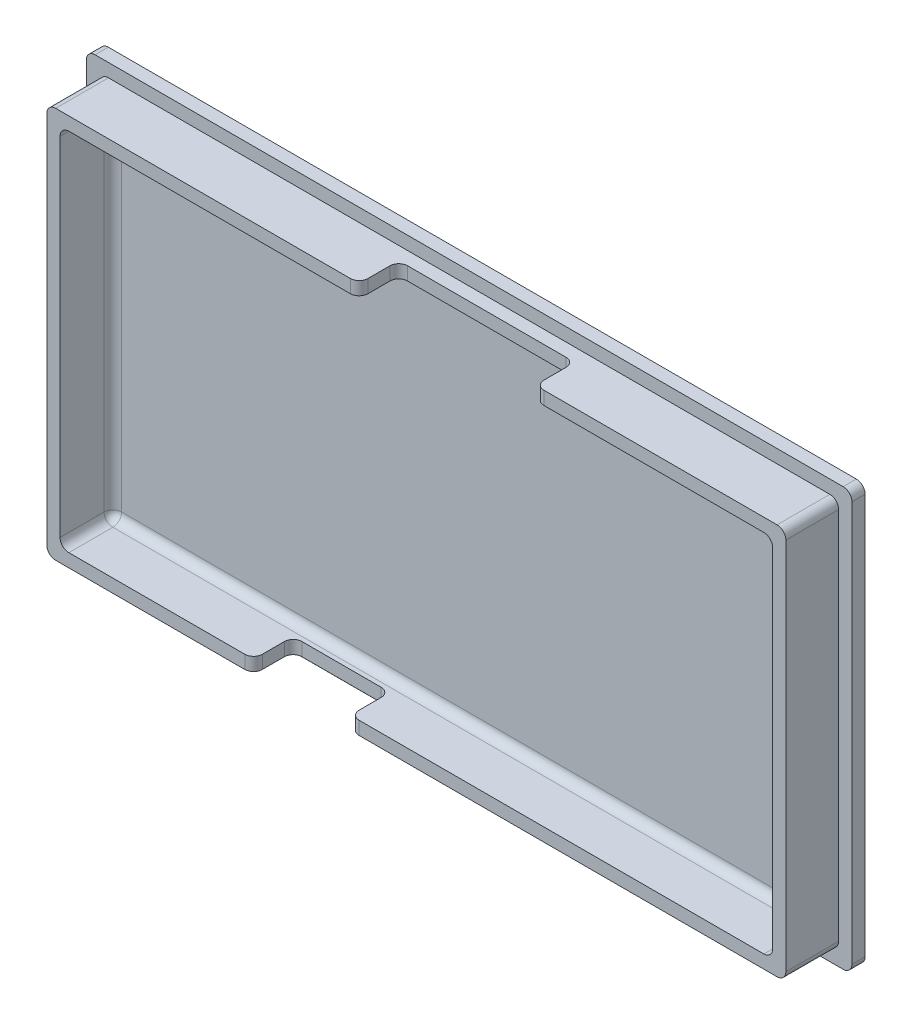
from build123d import *

# Parameters (mm, degrees)
SKETCH_1_W          = 87
SKETCH_1_H          = 47.5
EXTRUDE_1_DEPTH     = 1.5
SKETCH_2_W          = 83.98
SKETCH_2_H          = 44.48
SKETCH_2_W_2        = 80.98
SKETCH_2_H_2        = 41.48
EXTRUDE_2_DEPTH     = 6
FILLET_1_R          = 1
SKETCH_3_W          = 20
SKETCH_3_H          = 19.509729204
SKETCH_3_W_2        = 11
SKETCH_3_H_2        = 9.813144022
CUT_EXTRUDE_1_DEPTH = 4.5
FILLET_2_R          = 1


with BuildPart() as part:
    # Sketch 1 → Extrude 1 (new body)
    with BuildSketch(Plane.XY):
        Rectangle(SKETCH_1_W, SKETCH_1_H)
    extrude(amount=EXTRUDE_1_DEPTH)

    # Sketch 2 → Extrude 2 (add)
    with BuildSketch(Plane.XY.offset(1.5)):
        Rectangle(SKETCH_2_W, SKETCH_2_H)
        Rectangle(SKETCH_2_W_2, SKETCH_2_H_2, mode=Mode.SUBTRACT)
    extrude(amount=EXTRUDE_2_DEPTH)

    # Fillet 1
    fillet_1_edges = [part.edges().sort_by_distance(p)[0] for p in [
        (-40.49, 0, 1.5),
        (0, -20.74, 1.5),
        (40.49, 0, 1.5),
        (0, 20.74, 1.5),
        (-41.99, 22.24, 4.5),
        (-41.99, -22.24, 4.5),
        (41.99, -22.24, 4.5),
        (41.99, 22.24, 4.5),
        (-40.49, -20.74, 4.5),
        (40.49, -20.74, 4.5),
        (40.49, 20.74, 4.5),
        (-40.49, 20.74, 4.5),
        (-43.5, 23.75, 0.75),
        (43.5, 23.75, 0.75),
        (43.5, -23.75, 0.75),
        (-43.5, -23.75, 0.75),
    ]]
    fillet(fillet_1_edges, radius=FILLET_1_R)

    # Sketch 3 → Cut-Extrude 1 (cut)
    with BuildSketch(Plane.XY.offset(7.5)):
        with Locations((3.5, 21.356523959)):
            Rectangle(SKETCH_3_W, SKETCH_3_H)
        with Locations((-13, -22.24)):
            Rectangle(SKETCH_3_W_2, SKETCH_3_H_2)
    extrude(amount=-CUT_EXTRUDE_1_DEPTH, mode=Mode.SUBTRACT)

    # Fillet 2
    fillet_2_edges = [part.edges().sort_by_distance(p)[0] for p in [
        (-6.5, 21.49, 3),
        (13.5, 21.49, 3),
        (13.5, 21.49, 7.5),
        (-6.5, 21.49, 7.5),
        (-7.5, -21.49, 7.5),
        (-7.5, -21.49, 3),
        (-18.5, -21.49, 3),
        (-18.5, -21.49, 7.5),
    ]]
    fillet(fillet_2_edges, radius=FILLET_2_R)


solid = part.part
